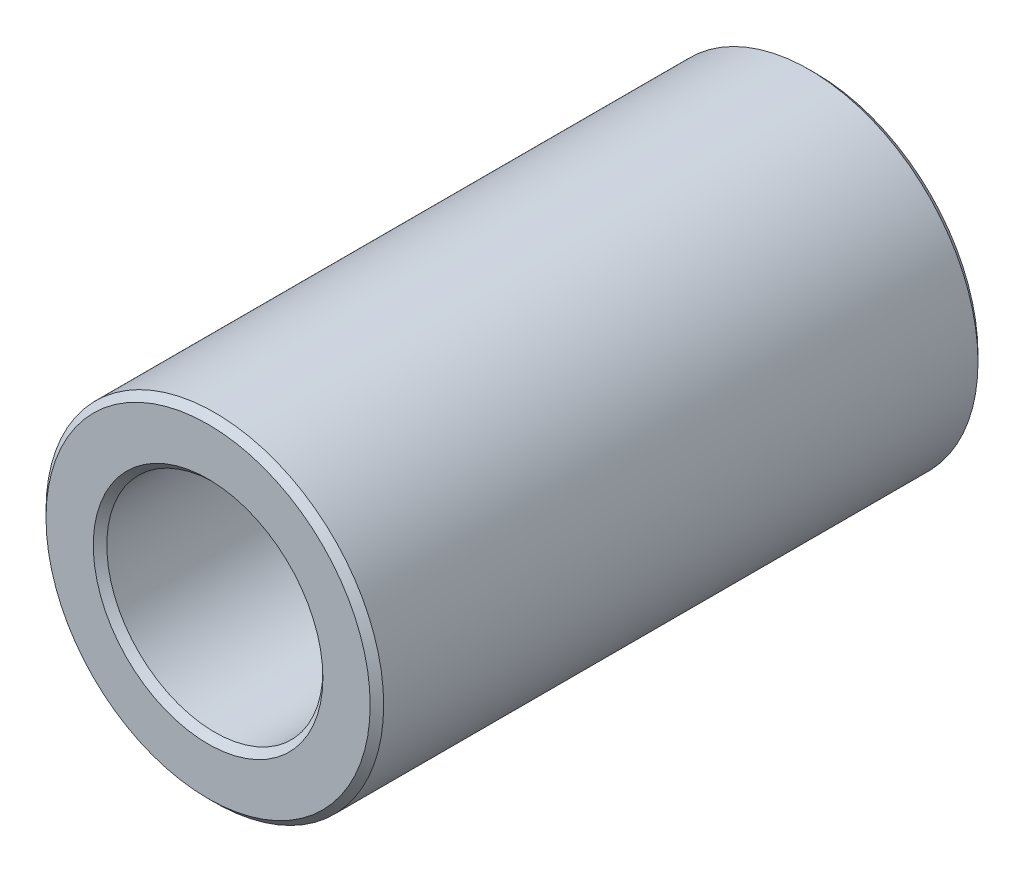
ISO-10303-21;
HEADER;
FILE_DESCRIPTION(('STEP AP214'),'2;1');
FILE_NAME('part.step','',(''),(''),'','','');
FILE_SCHEMA(('AUTOMOTIVE_DESIGN { 1 0 10303 214 1 1 1 1 }'));
ENDSEC;
DATA;
#1=APPLICATION_CONTEXT('core data for automotive mechanical design processes');
#2=APPLICATION_PROTOCOL_DEFINITION('international standard','automotive_design',2000,#1);
#3=PRODUCT_CONTEXT('',#1,'mechanical');
#4=PRODUCT('Part','Part','',(#3));
#5=PRODUCT_RELATED_PRODUCT_CATEGORY('part','',(#4));
#6=PRODUCT_DEFINITION_FORMATION('','',#4);
#7=PRODUCT_DEFINITION_CONTEXT('part definition',#1,'design');
#8=PRODUCT_DEFINITION('design','',#6,#7);
#9=PRODUCT_DEFINITION_SHAPE('','',#8);
#10=(LENGTH_UNIT() NAMED_UNIT(*) SI_UNIT(.MILLI.,.METRE.));
#11=(NAMED_UNIT(*) PLANE_ANGLE_UNIT() SI_UNIT($,.RADIAN.));
#12=(NAMED_UNIT(*) SI_UNIT($,.STERADIAN.) SOLID_ANGLE_UNIT());
#13=UNCERTAINTY_MEASURE_WITH_UNIT(LENGTH_MEASURE(1.E-05),#10,'distance_accuracy_value','');
#14=(GEOMETRIC_REPRESENTATION_CONTEXT(3) GLOBAL_UNCERTAINTY_ASSIGNED_CONTEXT((#13)) GLOBAL_UNIT_ASSIGNED_CONTEXT((#10,
#11,#12)) REPRESENTATION_CONTEXT('',''));
#15=CARTESIAN_POINT('',(0.,0.,0.));
#16=DIRECTION('',(0.,0.,1.));
#17=DIRECTION('',(1.,0.,0.));
#18=AXIS2_PLACEMENT_3D('',#15,#16,#17);
#19=CARTESIAN_POINT('',(0.,0.,9.));
#20=DIRECTION('',(0.,0.,1.));
#21=DIRECTION('',(1.,0.,0.));
#22=AXIS2_PLACEMENT_3D('',#19,#20,#21);
#23=PLANE('',#22);
#24=CARTESIAN_POINT('',(0.,0.,9.));
#25=DIRECTION('',(0.,0.,1.));
#26=DIRECTION('',(1.,0.,0.));
#27=AXIS2_PLACEMENT_3D('',#24,#25,#26);
#28=CIRCLE('',#27,3.40000000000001);
#29=CARTESIAN_POINT('',(3.40000000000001,0.,9.));
#30=VERTEX_POINT('',#29);
#31=EDGE_CURVE('E10',#30,#30,#28,.F.);
#32=ORIENTED_EDGE('',*,*,#31,.T.);
#33=EDGE_LOOP('',(#32));
#34=FACE_BOUND('',#33,.T.);
#35=CARTESIAN_POINT('',(0.,0.,9.));
#36=DIRECTION('',(0.,0.,1.));
#37=DIRECTION('',(1.,0.,0.));
#38=AXIS2_PLACEMENT_3D('',#35,#36,#37);
#39=CIRCLE('',#38,4.79999999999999);
#40=CARTESIAN_POINT('',(4.79999999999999,0.,9.));
#41=VERTEX_POINT('',#40);
#42=EDGE_CURVE('E45',#41,#41,#39,.T.);
#43=ORIENTED_EDGE('',*,*,#42,.T.);
#44=EDGE_LOOP('',(#43));
#45=FACE_BOUND('',#44,.T.);
#46=ADVANCED_FACE('F37',(#34,#45),#23,.T.);
#47=CARTESIAN_POINT('',(0.,0.,-9.));
#48=DIRECTION('',(0.,0.,1.));
#49=DIRECTION('',(1.,0.,0.));
#50=AXIS2_PLACEMENT_3D('',#47,#48,#49);
#51=PLANE('',#50);
#52=CARTESIAN_POINT('',(0.,0.,-9.));
#53=DIRECTION('',(0.,0.,1.));
#54=DIRECTION('',(1.,0.,0.));
#55=AXIS2_PLACEMENT_3D('',#52,#53,#54);
#56=CIRCLE('',#55,4.8);
#57=CARTESIAN_POINT('',(4.8,0.,-9.));
#58=VERTEX_POINT('',#57);
#59=EDGE_CURVE('E64',#58,#58,#56,.F.);
#60=ORIENTED_EDGE('',*,*,#59,.T.);
#61=EDGE_LOOP('',(#60));
#62=FACE_BOUND('',#61,.T.);
#63=CARTESIAN_POINT('',(0.,0.,-9.));
#64=DIRECTION('',(0.,0.,1.));
#65=DIRECTION('',(1.,0.,0.));
#66=AXIS2_PLACEMENT_3D('',#63,#64,#65);
#67=CIRCLE('',#66,3.4);
#68=CARTESIAN_POINT('',(3.4,0.,-9.));
#69=VERTEX_POINT('',#68);
#70=EDGE_CURVE('E67',#69,#69,#67,.T.);
#71=ORIENTED_EDGE('',*,*,#70,.T.);
#72=EDGE_LOOP('',(#71));
#73=FACE_BOUND('',#72,.T.);
#74=ADVANCED_FACE('F89',(#62,#73),#51,.F.);
#75=CARTESIAN_POINT('',(0.,0.,9.));
#76=DIRECTION('',(0.,0.,-1.));
#77=DIRECTION('',(-1.,0.,0.));
#78=AXIS2_PLACEMENT_3D('',#75,#76,#77);
#79=CYLINDRICAL_SURFACE('',#78,5.);
#80=CARTESIAN_POINT('',(0.,0.,-8.8));
#81=DIRECTION('',(0.,0.,1.));
#82=DIRECTION('',(1.,0.,0.));
#83=AXIS2_PLACEMENT_3D('',#80,#81,#82);
#84=CIRCLE('',#83,5.);
#85=CARTESIAN_POINT('',(5.,0.,-8.8));
#86=VERTEX_POINT('',#85);
#87=EDGE_CURVE('E71',#86,#86,#84,.T.);
#88=ORIENTED_EDGE('',*,*,#87,.T.);
#89=EDGE_LOOP('',(#88));
#90=FACE_BOUND('',#89,.T.);
#91=CARTESIAN_POINT('',(0.,0.,8.79999999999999));
#92=DIRECTION('',(0.,0.,1.));
#93=DIRECTION('',(1.,0.,0.));
#94=AXIS2_PLACEMENT_3D('',#91,#92,#93);
#95=CIRCLE('',#94,5.);
#96=CARTESIAN_POINT('',(5.,0.,8.79999999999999));
#97=VERTEX_POINT('',#96);
#98=EDGE_CURVE('E74',#97,#97,#95,.F.);
#99=ORIENTED_EDGE('',*,*,#98,.T.);
#100=EDGE_LOOP('',(#99));
#101=FACE_BOUND('',#100,.T.);
#102=ADVANCED_FACE('F78',(#90,#101),#79,.T.);
#103=CARTESIAN_POINT('',(0.,0.,9.));
#104=DIRECTION('',(0.,0.,-1.));
#105=DIRECTION('',(-1.,0.,0.));
#106=AXIS2_PLACEMENT_3D('',#103,#104,#105);
#107=CYLINDRICAL_SURFACE('',#106,3.2);
#108=CARTESIAN_POINT('',(0.,0.,-8.8));
#109=DIRECTION('',(0.,0.,1.));
#110=DIRECTION('',(1.,0.,0.));
#111=AXIS2_PLACEMENT_3D('',#108,#109,#110);
#112=CIRCLE('',#111,3.2);
#113=CARTESIAN_POINT('',(3.2,0.,-8.8));
#114=VERTEX_POINT('',#113);
#115=EDGE_CURVE('E52',#114,#114,#112,.F.);
#116=ORIENTED_EDGE('',*,*,#115,.T.);
#117=EDGE_LOOP('',(#116));
#118=FACE_BOUND('',#117,.T.);
#119=CARTESIAN_POINT('',(0.,0.,8.79999999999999));
#120=DIRECTION('',(0.,0.,1.));
#121=DIRECTION('',(1.,0.,0.));
#122=AXIS2_PLACEMENT_3D('',#119,#120,#121);
#123=CIRCLE('',#122,3.2);
#124=CARTESIAN_POINT('',(3.2,0.,8.79999999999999));
#125=VERTEX_POINT('',#124);
#126=EDGE_CURVE('E58',#125,#125,#123,.T.);
#127=ORIENTED_EDGE('',*,*,#126,.T.);
#128=EDGE_LOOP('',(#127));
#129=FACE_BOUND('',#128,.T.);
#130=ADVANCED_FACE('F97',(#118,#129),#107,.F.);
#131=CARTESIAN_POINT('',(0.,0.,-8.8));
#132=DIRECTION('',(0.,0.,1.));
#133=DIRECTION('',(1.,0.,0.));
#134=AXIS2_PLACEMENT_3D('',#131,#132,#133);
#135=CONICAL_SURFACE('',#134,5.,0.785398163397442);
#136=ORIENTED_EDGE('',*,*,#59,.F.);
#137=EDGE_LOOP('',(#136));
#138=FACE_BOUND('',#137,.T.);
#139=ORIENTED_EDGE('',*,*,#87,.F.);
#140=EDGE_LOOP('',(#139));
#141=FACE_BOUND('',#140,.T.);
#142=ADVANCED_FACE('F102',(#138,#141),#135,.T.);
#143=CARTESIAN_POINT('',(0.,0.,-9.));
#144=DIRECTION('',(0.,0.,-1.));
#145=DIRECTION('',(-1.,0.,0.));
#146=AXIS2_PLACEMENT_3D('',#143,#144,#145);
#147=CONICAL_SURFACE('',#146,3.4,0.785398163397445);
#148=ORIENTED_EDGE('',*,*,#115,.F.);
#149=EDGE_LOOP('',(#148));
#150=FACE_BOUND('',#149,.T.);
#151=ORIENTED_EDGE('',*,*,#70,.F.);
#152=EDGE_LOOP('',(#151));
#153=FACE_BOUND('',#152,.T.);
#154=ADVANCED_FACE('F86',(#150,#153),#147,.F.);
#155=CARTESIAN_POINT('',(0.,0.,8.79999999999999));
#156=DIRECTION('',(0.,0.,1.));
#157=DIRECTION('',(1.,0.,0.));
#158=AXIS2_PLACEMENT_3D('',#155,#156,#157);
#159=CONICAL_SURFACE('',#158,3.2,0.785398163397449);
#160=ORIENTED_EDGE('',*,*,#31,.F.);
#161=EDGE_LOOP('',(#160));
#162=FACE_BOUND('',#161,.T.);
#163=ORIENTED_EDGE('',*,*,#126,.F.);
#164=EDGE_LOOP('',(#163));
#165=FACE_BOUND('',#164,.T.);
#166=ADVANCED_FACE('F82',(#162,#165),#159,.F.);
#167=CARTESIAN_POINT('',(0.,0.,9.));
#168=DIRECTION('',(0.,0.,-1.));
#169=DIRECTION('',(-1.,0.,0.));
#170=AXIS2_PLACEMENT_3D('',#167,#168,#169);
#171=CONICAL_SURFACE('',#170,4.79999999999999,0.78539816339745);
#172=ORIENTED_EDGE('',*,*,#98,.F.);
#173=EDGE_LOOP('',(#172));
#174=FACE_BOUND('',#173,.T.);
#175=ORIENTED_EDGE('',*,*,#42,.F.);
#176=EDGE_LOOP('',(#175));
#177=FACE_BOUND('',#176,.T.);
#178=ADVANCED_FACE('F39',(#174,#177),#171,.T.);
#179=CLOSED_SHELL('',(#46,#74,#102,#130,#142,#154,#166,#178));
#180=MANIFOLD_SOLID_BREP('B2',#179);
#181=ADVANCED_BREP_SHAPE_REPRESENTATION('',(#18,#180),#14);
#182=SHAPE_DEFINITION_REPRESENTATION(#9,#181);
ENDSEC;
END-ISO-10303-21;
